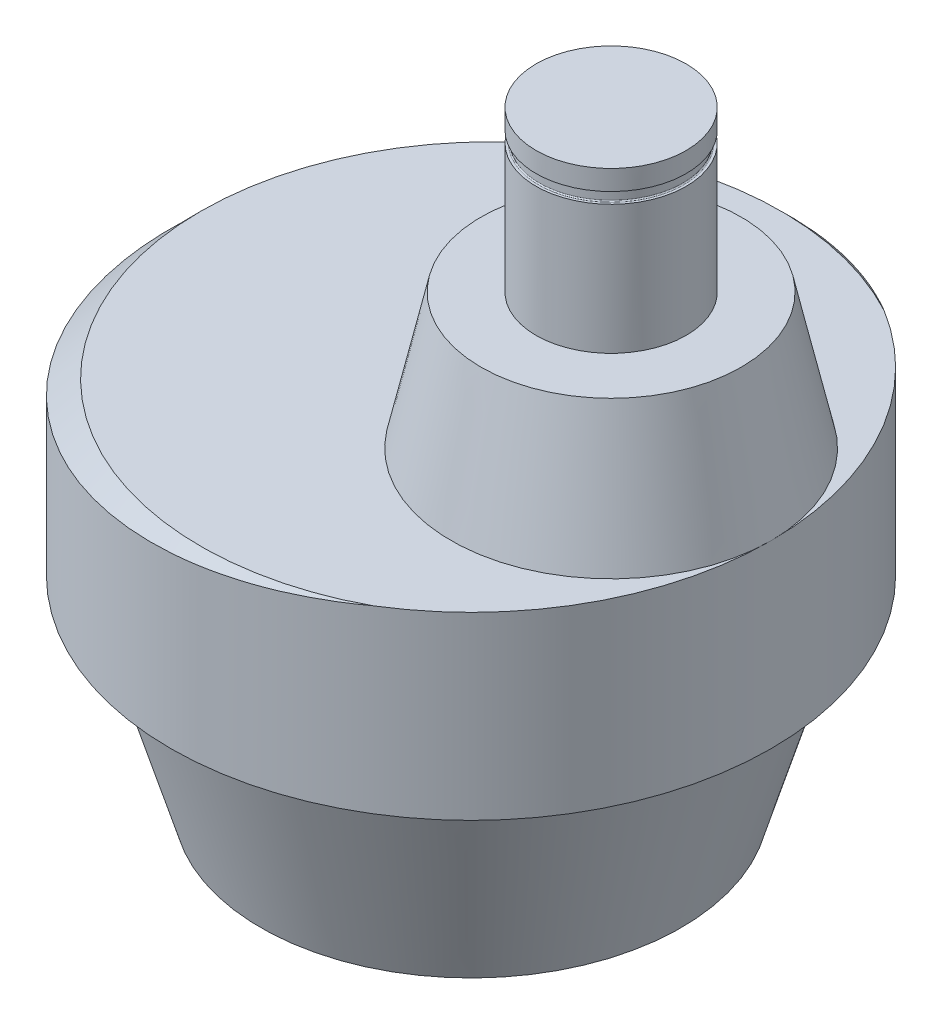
ISO-10303-21;
HEADER;
FILE_DESCRIPTION(('STEP AP214'),'2;1');
FILE_NAME('part.step','',(''),(''),'','','');
FILE_SCHEMA(('AUTOMOTIVE_DESIGN { 1 0 10303 214 1 1 1 1 }'));
ENDSEC;
DATA;
#1=APPLICATION_CONTEXT('core data for automotive mechanical design processes');
#2=APPLICATION_PROTOCOL_DEFINITION('international standard','automotive_design',2000,#1);
#3=PRODUCT_CONTEXT('',#1,'mechanical');
#4=PRODUCT('Part','Part','',(#3));
#5=PRODUCT_RELATED_PRODUCT_CATEGORY('part','',(#4));
#6=PRODUCT_DEFINITION_FORMATION('','',#4);
#7=PRODUCT_DEFINITION_CONTEXT('part definition',#1,'design');
#8=PRODUCT_DEFINITION('design','',#6,#7);
#9=PRODUCT_DEFINITION_SHAPE('','',#8);
#10=(LENGTH_UNIT() NAMED_UNIT(*) SI_UNIT(.MILLI.,.METRE.));
#11=(NAMED_UNIT(*) PLANE_ANGLE_UNIT() SI_UNIT($,.RADIAN.));
#12=(NAMED_UNIT(*) SI_UNIT($,.STERADIAN.) SOLID_ANGLE_UNIT());
#13=UNCERTAINTY_MEASURE_WITH_UNIT(LENGTH_MEASURE(1.E-05),#10,'distance_accuracy_value','');
#14=(GEOMETRIC_REPRESENTATION_CONTEXT(3) GLOBAL_UNCERTAINTY_ASSIGNED_CONTEXT((#13)) GLOBAL_UNIT_ASSIGNED_CONTEXT((#10,
#11,#12)) REPRESENTATION_CONTEXT('',''));
#15=CARTESIAN_POINT('',(0.,0.,0.));
#16=DIRECTION('',(0.,0.,1.));
#17=DIRECTION('',(1.,0.,0.));
#18=AXIS2_PLACEMENT_3D('',#15,#16,#17);
#19=CARTESIAN_POINT('',(14.,67.4999999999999,0.));
#20=DIRECTION('',(0.,-1.,0.));
#21=DIRECTION('',(0.,0.,-1.));
#22=AXIS2_PLACEMENT_3D('',#19,#20,#21);
#23=CYLINDRICAL_SURFACE('',#22,7.5);
#24=CARTESIAN_POINT('',(14.,51.4999999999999,0.));
#25=DIRECTION('',(0.,1.,0.));
#26=DIRECTION('',(0.,0.,1.));
#27=AXIS2_PLACEMENT_3D('',#24,#25,#26);
#28=CIRCLE('',#27,7.5);
#29=CARTESIAN_POINT('',(14.,51.4999999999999,7.5));
#30=VERTEX_POINT('',#29);
#31=EDGE_CURVE('E74',#30,#30,#28,.T.);
#32=ORIENTED_EDGE('',*,*,#31,.T.);
#33=EDGE_LOOP('',(#32));
#34=FACE_BOUND('',#33,.T.);
#35=CARTESIAN_POINT('',(14.,64.3999999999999,0.));
#36=DIRECTION('',(0.,-1.,0.));
#37=DIRECTION('',(0.,0.,-1.));
#38=AXIS2_PLACEMENT_3D('',#35,#36,#37);
#39=CIRCLE('',#38,7.50000000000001);
#40=CARTESIAN_POINT('',(14.,64.3999999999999,-7.50000000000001));
#41=VERTEX_POINT('',#40);
#42=EDGE_CURVE('E152',#41,#41,#39,.T.);
#43=ORIENTED_EDGE('',*,*,#42,.T.);
#44=EDGE_LOOP('',(#43));
#45=FACE_BOUND('',#44,.T.);
#46=ADVANCED_FACE('F34',(#34,#45),#23,.T.);
#47=CARTESIAN_POINT('',(14.,51.4999999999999,0.));
#48=DIRECTION('',(0.,1.,0.));
#49=DIRECTION('',(0.,0.,1.));
#50=AXIS2_PLACEMENT_3D('',#47,#48,#49);
#51=PLANE('',#50);
#52=CARTESIAN_POINT('',(14.,51.4999999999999,0.));
#53=DIRECTION('',(0.,1.,0.));
#54=DIRECTION('',(0.,0.,1.));
#55=AXIS2_PLACEMENT_3D('',#52,#53,#54);
#56=CIRCLE('',#55,13.);
#57=CARTESIAN_POINT('',(14.,51.4999999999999,13.));
#58=VERTEX_POINT('',#57);
#59=EDGE_CURVE('E91',#58,#58,#56,.T.);
#60=ORIENTED_EDGE('',*,*,#59,.T.);
#61=EDGE_LOOP('',(#60));
#62=FACE_BOUND('',#61,.T.);
#63=ORIENTED_EDGE('',*,*,#31,.F.);
#64=EDGE_LOOP('',(#63));
#65=FACE_BOUND('',#64,.T.);
#66=ADVANCED_FACE('F108',(#62,#65),#51,.T.);
#67=CARTESIAN_POINT('',(0.,37.9999999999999,0.));
#68=DIRECTION('',(0.,1.,0.));
#69=DIRECTION('',(0.,0.,1.));
#70=AXIS2_PLACEMENT_3D('',#67,#68,#69);
#71=PLANE('',#70);
#72=CARTESIAN_POINT('',(2.,37.9999999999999,0.));
#73=DIRECTION('',(0.,1.,0.));
#74=DIRECTION('',(0.,0.,1.));
#75=AXIS2_PLACEMENT_3D('',#72,#73,#74);
#76=CIRCLE('',#75,29.);
#77=CARTESIAN_POINT('',(15.75,37.9999999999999,-25.5330667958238));
#78=VERTEX_POINT('',#77);
#79=CARTESIAN_POINT('',(15.75,37.9999999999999,25.5330667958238));
#80=VERTEX_POINT('',#79);
#81=EDGE_CURVE('E70',#78,#80,#76,.T.);
#82=ORIENTED_EDGE('',*,*,#81,.T.);
#83=CARTESIAN_POINT('',(0.,37.9999999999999,0.));
#84=DIRECTION('',(0.,-1.,0.));
#85=DIRECTION('',(0.,0.,-1.));
#86=AXIS2_PLACEMENT_3D('',#83,#84,#85);
#87=CIRCLE('',#86,30.);
#88=CARTESIAN_POINT('',(29.9999999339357,37.9999999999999,0.00175288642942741));
#89=VERTEX_POINT('',#88);
#90=EDGE_CURVE('E217',#89,#80,#87,.T.);
#91=ORIENTED_EDGE('',*,*,#90,.F.);
#92=CARTESIAN_POINT('',(14.,37.9999999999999,0.));
#93=DIRECTION('',(0.,1.,0.));
#94=DIRECTION('',(0.,0.,1.));
#95=AXIS2_PLACEMENT_3D('',#92,#93,#94);
#96=CIRCLE('',#95,16.);
#97=EDGE_CURVE('E84',#89,#89,#96,.T.);
#98=ORIENTED_EDGE('',*,*,#97,.F.);
#99=EDGE_CURVE('E51',#78,#89,#87,.T.);
#100=ORIENTED_EDGE('',*,*,#99,.F.);
#101=EDGE_LOOP('',(#82,#91,#98,#100));
#102=FACE_BOUND('',#101,.T.);
#103=ADVANCED_FACE('F111',(#102),#71,.T.);
#104=CARTESIAN_POINT('',(21.,0.,0.));
#105=DIRECTION('',(0.,-1.,0.));
#106=DIRECTION('',(0.,0.,-1.));
#107=AXIS2_PLACEMENT_3D('',#104,#105,#106);
#108=PLANE('',#107);
#109=CARTESIAN_POINT('',(0.,0.,0.));
#110=DIRECTION('',(0.,-1.,0.));
#111=DIRECTION('',(0.,0.,-1.));
#112=AXIS2_PLACEMENT_3D('',#109,#110,#111);
#113=CIRCLE('',#112,13.);
#114=CARTESIAN_POINT('',(0.,0.,-13.));
#115=VERTEX_POINT('',#114);
#116=EDGE_CURVE('E71',#115,#115,#113,.T.);
#117=ORIENTED_EDGE('',*,*,#116,.F.);
#118=EDGE_LOOP('',(#117));
#119=FACE_BOUND('',#118,.T.);
#120=CARTESIAN_POINT('',(0.,0.,0.));
#121=DIRECTION('',(0.,-1.,0.));
#122=DIRECTION('',(0.,0.,-1.));
#123=AXIS2_PLACEMENT_3D('',#120,#121,#122);
#124=CIRCLE('',#123,21.);
#125=CARTESIAN_POINT('',(0.,0.,-21.));
#126=VERTEX_POINT('',#125);
#127=EDGE_CURVE('E43',#126,#126,#124,.T.);
#128=ORIENTED_EDGE('',*,*,#127,.T.);
#129=EDGE_LOOP('',(#128));
#130=FACE_BOUND('',#129,.T.);
#131=ADVANCED_FACE('F36',(#119,#130),#108,.T.);
#132=CARTESIAN_POINT('',(0.,0.,0.));
#133=DIRECTION('',(0.,1.,0.));
#134=DIRECTION('',(0.,0.,1.));
#135=AXIS2_PLACEMENT_3D('',#132,#133,#134);
#136=CONICAL_SURFACE('',#135,21.,0.291456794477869);
#137=CARTESIAN_POINT('',(0.,17.8620436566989,0.));
#138=DIRECTION('',(0.,-1.,0.));
#139=DIRECTION('',(0.,0.,-1.));
#140=AXIS2_PLACEMENT_3D('',#137,#138,#139);
#141=CIRCLE('',#140,26.3586130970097);
#142=CARTESIAN_POINT('',(0.,17.8620436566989,-26.3586130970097));
#143=VERTEX_POINT('',#142);
#144=EDGE_CURVE('E210',#143,#143,#141,.T.);
#145=ORIENTED_EDGE('',*,*,#144,.T.);
#146=EDGE_LOOP('',(#145));
#147=FACE_BOUND('',#146,.T.);
#148=ORIENTED_EDGE('',*,*,#127,.F.);
#149=EDGE_LOOP('',(#148));
#150=FACE_BOUND('',#149,.T.);
#151=ADVANCED_FACE('F206',(#147,#150),#136,.T.);
#152=CARTESIAN_POINT('',(0.,16.9999999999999,0.));
#153=DIRECTION('',(0.,-1.,0.));
#154=DIRECTION('',(0.,0.,-1.));
#155=AXIS2_PLACEMENT_3D('',#152,#153,#154);
#156=TOROIDAL_SURFACE('',#155,29.2320919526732,2.99999999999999);
#157=CARTESIAN_POINT('',(0.,19.9999999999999,0.));
#158=DIRECTION('',(0.,-1.,0.));
#159=DIRECTION('',(0.,0.,-1.));
#160=AXIS2_PLACEMENT_3D('',#157,#158,#159);
#161=CIRCLE('',#160,29.2320919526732);
#162=CARTESIAN_POINT('',(0.,19.9999999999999,-29.2320919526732));
#163=VERTEX_POINT('',#162);
#164=EDGE_CURVE('E213',#163,#163,#161,.T.);
#165=ORIENTED_EDGE('',*,*,#164,.T.);
#166=EDGE_LOOP('',(#165));
#167=FACE_BOUND('',#166,.T.);
#168=ORIENTED_EDGE('',*,*,#144,.F.);
#169=EDGE_LOOP('',(#168));
#170=FACE_BOUND('',#169,.T.);
#171=ADVANCED_FACE('F242',(#167,#170),#156,.F.);
#172=CARTESIAN_POINT('',(30.0000000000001,19.9999999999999,0.));
#173=DIRECTION('',(0.,-1.,0.));
#174=DIRECTION('',(0.,0.,-1.));
#175=AXIS2_PLACEMENT_3D('',#172,#173,#174);
#176=PLANE('',#175);
#177=CARTESIAN_POINT('',(0.,19.9999999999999,0.));
#178=DIRECTION('',(0.,-1.,0.));
#179=DIRECTION('',(0.,0.,-1.));
#180=AXIS2_PLACEMENT_3D('',#177,#178,#179);
#181=CIRCLE('',#180,30.);
#182=CARTESIAN_POINT('',(0.,19.9999999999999,-30.));
#183=VERTEX_POINT('',#182);
#184=EDGE_CURVE('E218',#183,#183,#181,.T.);
#185=ORIENTED_EDGE('',*,*,#184,.T.);
#186=EDGE_LOOP('',(#185));
#187=FACE_BOUND('',#186,.T.);
#188=ORIENTED_EDGE('',*,*,#164,.F.);
#189=EDGE_LOOP('',(#188));
#190=FACE_BOUND('',#189,.T.);
#191=ADVANCED_FACE('F118',(#187,#190),#176,.T.);
#192=CARTESIAN_POINT('',(0.,-11.5818835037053,0.));
#193=DIRECTION('',(0.,-1.,0.));
#194=DIRECTION('',(0.,0.,-1.));
#195=AXIS2_PLACEMENT_3D('',#192,#193,#194);
#196=CYLINDRICAL_SURFACE('',#195,30.);
#197=CARTESIAN_POINT('',(29.6948529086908,38.9782122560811,-4.26798673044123));
#198=CARTESIAN_POINT('',(29.5963193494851,38.9711796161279,-4.95353970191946));
#199=CARTESIAN_POINT('',(29.4740370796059,38.9624544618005,-5.635668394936));
#200=CARTESIAN_POINT('',(29.1825784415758,38.941671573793,-6.98976053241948));
#201=CARTESIAN_POINT('',(29.013403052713,38.9296139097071,-7.661724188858));
#202=CARTESIAN_POINT('',(28.6288764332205,38.9022299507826,-8.99263307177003));
#203=CARTESIAN_POINT('',(28.4135008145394,38.88690192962,-9.65157122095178));
#204=CARTESIAN_POINT('',(27.937682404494,38.8530719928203,-10.9528979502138));
#205=CARTESIAN_POINT('',(27.677237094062,38.8345698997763,-11.5952856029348));
#206=CARTESIAN_POINT('',(27.0520126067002,38.7902048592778,-12.9959967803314));
#207=CARTESIAN_POINT('',(26.6768346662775,38.7636141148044,-13.7496823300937));
#208=CARTESIAN_POINT('',(25.8645304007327,38.7061366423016,-15.2228038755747));
#209=CARTESIAN_POINT('',(25.427396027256,38.6752493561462,-15.9422354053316));
#210=CARTESIAN_POINT('',(24.4941371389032,38.609428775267,-17.3420030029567));
#211=CARTESIAN_POINT('',(23.9979886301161,38.5744938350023,-18.0223230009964));
#212=CARTESIAN_POINT('',(22.9504112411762,38.5008823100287,-19.3387228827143));
#213=CARTESIAN_POINT('',(22.3989840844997,38.4622058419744,-19.9748041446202));
#214=CARTESIAN_POINT('',(21.2438438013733,38.3813651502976,-21.199260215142));
#215=CARTESIAN_POINT('',(20.6400486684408,38.3391954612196,-21.7875573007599));
#216=CARTESIAN_POINT('',(19.3852314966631,38.2517655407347,-22.9111781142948));
#217=CARTESIAN_POINT('',(18.7342090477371,38.2065052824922,-23.4465013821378));
#218=CARTESIAN_POINT('',(17.3896331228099,38.1132618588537,-24.460366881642));
#219=CARTESIAN_POINT('',(16.6960834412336,38.0652789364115,-24.9389141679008));
#220=CARTESIAN_POINT('',(15.2713237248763,37.9669650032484,-25.8359307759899));
#221=CARTESIAN_POINT('',(14.5401137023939,37.9166339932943,-26.2544001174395));
#222=CARTESIAN_POINT('',(13.0434031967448,37.8138897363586,-27.0292709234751));
#223=CARTESIAN_POINT('',(12.2778241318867,37.7614717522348,-27.3855199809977));
#224=CARTESIAN_POINT('',(10.7194633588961,37.6550689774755,-28.032209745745));
#225=CARTESIAN_POINT('',(9.92668159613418,37.6010841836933,-28.3226503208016));
#226=CARTESIAN_POINT('',(8.31951972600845,37.4919519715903,-28.8356923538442));
#227=CARTESIAN_POINT('',(7.50513908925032,37.4368045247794,-29.0582921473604));
#228=CARTESIAN_POINT('',(5.8605686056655,37.3257551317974,-29.434082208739));
#229=CARTESIAN_POINT('',(5.03037874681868,37.2698531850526,-29.5872724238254));
#230=CARTESIAN_POINT('',(3.35862243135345,37.1576028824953,-29.8233719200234));
#231=CARTESIAN_POINT('',(2.51703878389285,37.1012539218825,-29.9061592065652));
#232=CARTESIAN_POINT('',(0.829882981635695,36.9886081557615,-30.0004190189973));
#233=CARTESIAN_POINT('',(-0.015689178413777,36.9323113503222,-30.0118914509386));
#234=CARTESIAN_POINT('',(-1.70481762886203,36.8201654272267,-29.963435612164));
#235=CARTESIAN_POINT('',(-2.54837391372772,36.7643163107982,-29.9035071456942));
#236=CARTESIAN_POINT('',(-4.22747359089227,36.6534521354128,-29.7126642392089));
#237=CARTESIAN_POINT('',(-5.06301698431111,36.5984370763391,-29.5817498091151));
#238=CARTESIAN_POINT('',(-6.72047114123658,36.4895944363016,-29.2497843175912));
#239=CARTESIAN_POINT('',(-7.54237648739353,36.4357673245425,-29.0487060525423));
#240=CARTESIAN_POINT('',(-9.16636639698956,36.3296840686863,-28.5778322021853));
#241=CARTESIAN_POINT('',(-9.96845095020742,36.2774279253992,-28.3080365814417));
#242=CARTESIAN_POINT('',(-11.5470747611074,36.1748328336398,-27.7016246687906));
#243=CARTESIAN_POINT('',(-12.3236140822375,36.1244938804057,-27.3650085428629));
#244=CARTESIAN_POINT('',(-13.8456004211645,36.026062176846,-26.6273262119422));
#245=CARTESIAN_POINT('',(-14.5910474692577,35.9779694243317,-26.2262600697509));
#246=CARTESIAN_POINT('',(-16.0447898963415,35.8843874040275,-25.3629390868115));
#247=CARTESIAN_POINT('',(-16.753121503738,35.8388955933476,-24.900745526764));
#248=CARTESIAN_POINT('',(-18.1283604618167,35.7507538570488,-23.9181259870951));
#249=CARTESIAN_POINT('',(-18.7952678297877,35.7081039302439,-23.3977000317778));
#250=CARTESIAN_POINT('',(-20.0828721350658,35.6259155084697,-22.3023025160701));
#251=CARTESIAN_POINT('',(-20.7035693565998,35.5863769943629,-21.7273312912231));
#252=CARTESIAN_POINT('',(-21.8942979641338,35.5106585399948,-20.5269193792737));
#253=CARTESIAN_POINT('',(-22.4643294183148,35.4744785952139,-19.9014787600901));
#254=CARTESIAN_POINT('',(-23.5486188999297,35.4057654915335,-18.6057749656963));
#255=CARTESIAN_POINT('',(-24.0629781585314,35.3732257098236,-17.9355968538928));
#256=CARTESIAN_POINT('',(-25.0334346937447,35.3119158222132,-16.5541443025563));
#257=CARTESIAN_POINT('',(-25.48953203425,35.2831457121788,-15.8428699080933));
#258=CARTESIAN_POINT('',(-26.3401784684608,35.2295509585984,-14.3842885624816));
#259=CARTESIAN_POINT('',(-26.7347280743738,35.2047262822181,-13.6369819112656));
#260=CARTESIAN_POINT('',(-27.4594390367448,35.1591728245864,-12.1116539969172));
#261=CARTESIAN_POINT('',(-27.7896004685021,35.1384440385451,-11.3336327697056));
#262=CARTESIAN_POINT('',(-28.3825829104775,35.101243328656,-9.75394217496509));
#263=CARTESIAN_POINT('',(-28.6455317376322,35.0847633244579,-8.95232097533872));
#264=CARTESIAN_POINT('',(-29.1030206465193,35.0561071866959,-7.32971506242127));
#265=CARTESIAN_POINT('',(-29.2975608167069,35.0439310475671,-6.5087303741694));
#266=CARTESIAN_POINT('',(-29.6168296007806,35.0239555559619,-4.85325016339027));
#267=CARTESIAN_POINT('',(-29.7415586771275,35.016156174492,-4.01875473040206));
#268=CARTESIAN_POINT('',(-29.9203077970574,35.0049806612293,-2.34219557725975));
#269=CARTESIAN_POINT('',(-29.9743278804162,35.0016045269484,-1.50013186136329));
#270=CARTESIAN_POINT('',(-30.0112465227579,34.9992970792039,0.184508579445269));
#271=CARTESIAN_POINT('',(-29.994233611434,35.0003602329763,1.0270833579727));
#272=CARTESIAN_POINT('',(-29.8894089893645,35.0069125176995,2.70779935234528));
#273=CARTESIAN_POINT('',(-29.8015973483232,35.0124016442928,3.54594057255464));
#274=CARTESIAN_POINT('',(-29.5558074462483,35.0277731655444,5.21182718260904));
#275=CARTESIAN_POINT('',(-29.3978293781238,35.0376555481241,6.03957260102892));
#276=CARTESIAN_POINT('',(-29.0128426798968,35.0617546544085,7.67878698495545));
#277=CARTESIAN_POINT('',(-28.785834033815,35.0759713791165,8.49025594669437));
#278=CARTESIAN_POINT('',(-28.2644501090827,35.1086521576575,10.091053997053));
#279=CARTESIAN_POINT('',(-27.9700832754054,35.1271156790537,10.880385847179));
#280=CARTESIAN_POINT('',(-27.3160797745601,35.1681803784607,12.4314174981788));
#281=CARTESIAN_POINT('',(-26.9564431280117,35.1907815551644,13.1931173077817));
#282=CARTESIAN_POINT('',(-26.174476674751,35.2399856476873,14.6834922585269));
#283=CARTESIAN_POINT('',(-25.7521467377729,35.2665885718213,15.4121673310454));
#284=CARTESIAN_POINT('',(-24.8478164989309,35.3236353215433,16.8313393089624));
#285=CARTESIAN_POINT('',(-24.365816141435,35.3540791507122,17.5218361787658));
#286=CARTESIAN_POINT('',(-23.3450590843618,35.4186561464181,18.8604725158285));
#287=CARTESIAN_POINT('',(-22.8062440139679,35.4527931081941,19.5085672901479));
#288=CARTESIAN_POINT('',(-21.6761212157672,35.5245211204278,20.7570406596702));
#289=CARTESIAN_POINT('',(-21.0848134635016,35.562112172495,21.3574192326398));
#290=CARTESIAN_POINT('',(-19.8539191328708,35.6405163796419,22.5062351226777));
#291=CARTESIAN_POINT('',(-19.2143322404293,35.6813295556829,23.0546721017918));
#292=CARTESIAN_POINT('',(-17.8914361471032,35.7659235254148,24.0957462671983));
#293=CARTESIAN_POINT('',(-17.2081268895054,35.809704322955,24.5883833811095));
#294=CARTESIAN_POINT('',(-15.8013559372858,35.9000407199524,25.5152496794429));
#295=CARTESIAN_POINT('',(-15.0778231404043,35.9466012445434,25.9493704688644));
#296=CARTESIAN_POINT('',(-13.5968981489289,36.0421274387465,26.7550919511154));
#297=CARTESIAN_POINT('',(-12.8395059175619,36.0910931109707,27.1266925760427));
#298=CARTESIAN_POINT('',(-11.2962374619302,36.1911140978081,27.804772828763));
#299=CARTESIAN_POINT('',(-10.5103610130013,36.2421694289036,28.1112519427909));
#300=CARTESIAN_POINT('',(-8.91570403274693,36.3460359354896,28.656943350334));
#301=CARTESIAN_POINT('',(-8.1069234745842,36.3988471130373,28.8961555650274));
#302=CARTESIAN_POINT('',(-6.47060788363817,36.5059791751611,29.3060401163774));
#303=CARTESIAN_POINT('',(-5.6430396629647,36.5603027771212,29.4765792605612));
#304=CARTESIAN_POINT('',(-3.9765381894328,36.6699957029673,29.7472649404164));
#305=CARTESIAN_POINT('',(-3.13760492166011,36.7253650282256,29.847411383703));
#306=CARTESIAN_POINT('',(-1.45431941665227,36.8367710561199,29.9766158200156));
#307=CARTESIAN_POINT('',(-0.609967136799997,36.8928077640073,30.0056732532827));
#308=CARTESIAN_POINT('',(1.07816267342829,37.0051586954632,29.9924999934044));
#309=CARTESIAN_POINT('',(1.92194020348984,37.0614729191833,29.9502692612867));
#310=CARTESIAN_POINT('',(3.60397939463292,37.1740506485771,29.7947239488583));
#311=CARTESIAN_POINT('',(4.4422329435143,37.2303140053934,29.6813215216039));
#312=CARTESIAN_POINT('',(6.10621021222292,37.3423147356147,29.3841535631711));
#313=CARTESIAN_POINT('',(6.93193391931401,37.3980521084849,29.2003879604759));
#314=CARTESIAN_POINT('',(8.56498242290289,37.5085923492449,28.7637870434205));
#315=CARTESIAN_POINT('',(9.37230715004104,37.5633952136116,28.5109514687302));
#316=CARTESIAN_POINT('',(10.9628080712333,37.6716570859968,27.9379908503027));
#317=CARTESIAN_POINT('',(11.7459842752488,37.7251160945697,27.6178658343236));
#318=CARTESIAN_POINT('',(13.282561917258,37.8302808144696,26.9126015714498));
#319=CARTESIAN_POINT('',(14.0359651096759,37.8819866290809,26.5274661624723));
#320=CARTESIAN_POINT('',(15.5076687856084,37.9832481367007,25.6948824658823));
#321=CARTESIAN_POINT('',(16.2259692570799,38.0328038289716,25.2474341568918));
#322=CARTESIAN_POINT('',(17.6223152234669,38.1293735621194,24.2933938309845));
#323=CARTESIAN_POINT('',(18.3003616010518,38.1763876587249,23.7868031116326));
#324=CARTESIAN_POINT('',(19.6113563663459,38.2674983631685,22.7180529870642));
#325=CARTESIAN_POINT('',(20.2443048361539,38.3115949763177,22.1558936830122));
#326=CARTESIAN_POINT('',(21.4596238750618,38.3964459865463,20.9808926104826));
#327=CARTESIAN_POINT('',(22.0420705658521,38.4372054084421,20.3681299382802));
#328=CARTESIAN_POINT('',(23.1532915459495,38.5151206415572,19.0955146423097));
#329=CARTESIAN_POINT('',(23.6820657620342,38.5522764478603,18.4356619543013));
#330=CARTESIAN_POINT('',(24.6821874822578,38.6226764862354,17.0734778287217));
#331=CARTESIAN_POINT('',(25.1535288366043,38.6559202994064,16.3711418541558));
#332=CARTESIAN_POINT('',(26.0353121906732,38.7182086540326,14.9290586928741));
#333=CARTESIAN_POINT('',(26.4457548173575,38.7472532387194,14.1893118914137));
#334=CARTESIAN_POINT('',(27.201967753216,38.8008360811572,12.6792918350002));
#335=CARTESIAN_POINT('',(27.5478741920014,38.8253838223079,11.9090870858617));
#336=CARTESIAN_POINT('',(28.173609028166,38.8698372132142,10.3421220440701));
#337=CARTESIAN_POINT('',(28.4534351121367,38.8897427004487,9.54536082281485));
#338=CARTESIAN_POINT('',(28.9448455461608,38.9247275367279,7.93140597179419));
#339=CARTESIAN_POINT('',(29.1564636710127,38.9398092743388,7.11422267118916));
#340=CARTESIAN_POINT('',(29.5100925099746,38.9650255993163,5.46493413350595));
#341=CARTESIAN_POINT('',(29.6521134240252,38.9751609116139,4.63283110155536));
#342=CARTESIAN_POINT('',(29.8441624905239,38.9888703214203,3.12742868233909));
#343=CARTESIAN_POINT('',(29.906923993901,38.9933523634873,2.45573033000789));
#344=CARTESIAN_POINT('',(29.9870507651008,38.9990749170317,1.10962906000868));
#345=CARTESIAN_POINT('',(30.0044187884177,39.0003156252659,0.435226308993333));
#346=CARTESIAN_POINT('',(29.9936798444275,38.9995485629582,-0.912887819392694));
#347=CARTESIAN_POINT('',(29.9655944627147,38.9975423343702,-1.58659937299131));
#348=CARTESIAN_POINT('',(29.8641201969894,38.9902957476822,-2.93061699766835));
#349=CARTESIAN_POINT('',(29.7907290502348,38.9850552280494,-3.60092289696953));
#350=CARTESIAN_POINT('',(29.6948529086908,38.9782122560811,-4.26798673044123));
#351=B_SPLINE_CURVE_WITH_KNOTS('',3,(#197,#198,#199,#200,#201,#202,#203,#204,#205,#206,#207,
#208,#209,#210,#211,#212,#213,#214,#215,#216,#217,#218,#219,#220,#221,#222,#223,#224,#225,#226,
#227,#228,#229,#230,#231,#232,#233,#234,#235,#236,#237,#238,#239,#240,#241,#242,#243,#244,#245,
#246,#247,#248,#249,#250,#251,#252,#253,#254,#255,#256,#257,#258,#259,#260,#261,#262,#263,#264,
#265,#266,#267,#268,#269,#270,#271,#272,#273,#274,#275,#276,#277,#278,#279,#280,#281,#282,#283,
#284,#285,#286,#287,#288,#289,#290,#291,#292,#293,#294,#295,#296,#297,#298,#299,#300,#301,#302,
#303,#304,#305,#306,#307,#308,#309,#310,#311,#312,#313,#314,#315,#316,#317,#318,#319,#320,#321,
#322,#323,#324,#325,#326,#327,#328,#329,#330,#331,#332,#333,#334,#335,#336,#337,#338,#339,#340,
#341,#342,#343,#344,#345,#346,#347,#348,#349,#350),.UNSPECIFIED.,.T.,.F.,(4,2,2,2,2,2,2,2,2,2,2,
2,2,2,2,2,2,2,2,2,2,2,2,2,2,2,2,2,2,2,2,2,2,2,2,2,2,2,2,2,2,2,2,2,2,2,2,2,2,2,2,2,2,2,2,2,2,2,2,
2,2,2,2,2,2,2,2,2,2,2,2,2,2,2,2,2,4),(0.,2.07749384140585,4.15494430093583,6.23349410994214,
8.31216013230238,10.8360456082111,13.3602592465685,15.8855027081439,18.4106674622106,
20.9398605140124,23.4690755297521,25.9980652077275,28.5270540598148,31.0621532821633,
33.5972575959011,36.1324241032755,38.6675925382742,41.2071450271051,43.7467008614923,
46.2862636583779,48.8258261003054,51.3663742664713,53.9069237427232,56.4474669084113,
58.9880075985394,61.5260204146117,64.0640321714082,66.6020283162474,69.1400210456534,
71.6733184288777,74.2066130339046,76.7398865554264,79.2731571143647,81.801573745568,
84.3299871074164,86.8583837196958,89.3867789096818,91.912023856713,94.4372663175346,
96.9625018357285,99.4877379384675,102.012657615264,104.537576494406,107.062500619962,
109.587427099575,112.114973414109,114.64252090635,117.170084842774,119.697652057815,
122.229838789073,124.762028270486,127.294237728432,129.826450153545,132.363550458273,
134.900654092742,137.437777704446,139.974902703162,142.515165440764,145.055430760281,
147.595705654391,150.135979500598,152.676103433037,155.216228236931,157.756297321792,
160.296361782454,162.832528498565,165.368698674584,167.90514018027,170.441555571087,
172.972558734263,175.503650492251,178.033486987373,180.562952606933,182.585399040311,
184.607722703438,186.629086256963,188.650550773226),.UNSPECIFIED.);
#352=EDGE_CURVE('E12',#78,#80,#351,.T.);
#353=ORIENTED_EDGE('',*,*,#352,.F.);
#354=ORIENTED_EDGE('',*,*,#99,.T.);
#355=ORIENTED_EDGE('',*,*,#90,.T.);
#356=EDGE_LOOP('',(#353,#354,#355));
#357=FACE_BOUND('',#356,.T.);
#358=ORIENTED_EDGE('',*,*,#184,.F.);
#359=EDGE_LOOP('',(#358));
#360=FACE_BOUND('',#359,.T.);
#361=ADVANCED_FACE('F107',(#357,#360),#196,.T.);
#362=CARTESIAN_POINT('',(14.,51.4999999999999,0.));
#363=DIRECTION('',(0.,-1.,0.));
#364=DIRECTION('',(0.,0.,-1.));
#365=AXIS2_PLACEMENT_3D('',#362,#363,#364);
#366=CONICAL_SURFACE('',#365,13.,0.218668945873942);
#367=ORIENTED_EDGE('',*,*,#59,.F.);
#368=EDGE_LOOP('',(#367));
#369=FACE_BOUND('',#368,.T.);
#370=ORIENTED_EDGE('',*,*,#97,.T.);
#371=EDGE_LOOP('',(#370));
#372=FACE_BOUND('',#371,.T.);
#373=ADVANCED_FACE('F97',(#369,#372),#366,.T.);
#374=CARTESIAN_POINT('',(2.,34.9999999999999,0.));
#375=DIRECTION('',(0.,-1.,0.));
#376=DIRECTION('',(0.,0.,-1.));
#377=AXIS2_PLACEMENT_3D('',#374,#375,#376);
#378=CONICAL_SURFACE('',#377,32.,0.78539816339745);
#379=ORIENTED_EDGE('',*,*,#81,.F.);
#380=ORIENTED_EDGE('',*,*,#352,.T.);
#381=EDGE_LOOP('',(#379,#380));
#382=FACE_BOUND('',#381,.T.);
#383=ADVANCED_FACE('F64',(#382),#378,.T.);
#384=CARTESIAN_POINT('',(0.,30.,0.));
#385=DIRECTION('',(0.,-1.,0.));
#386=DIRECTION('',(0.,0.,-1.));
#387=AXIS2_PLACEMENT_3D('',#384,#385,#386);
#388=CONICAL_SURFACE('',#387,13.,1.02974425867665);
#389=CARTESIAN_POINT('',(0.,37.8111880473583,0.));
#390=VERTEX_POINT('',#389);
#391=VERTEX_LOOP('',#390);
#392=FACE_BOUND('',#391,.T.);
#393=CARTESIAN_POINT('',(0.,30.,0.));
#394=DIRECTION('',(0.,-1.,0.));
#395=DIRECTION('',(0.,0.,-1.));
#396=AXIS2_PLACEMENT_3D('',#393,#394,#395);
#397=CIRCLE('',#396,13.);
#398=CARTESIAN_POINT('',(0.,30.,-13.));
#399=VERTEX_POINT('',#398);
#400=EDGE_CURVE('E68',#399,#399,#397,.T.);
#401=ORIENTED_EDGE('',*,*,#400,.T.);
#402=EDGE_LOOP('',(#401));
#403=FACE_BOUND('',#402,.T.);
#404=ADVANCED_FACE('F60',(#392,#403),#388,.F.);
#405=CARTESIAN_POINT('',(0.,0.,0.));
#406=DIRECTION('',(0.,-1.,0.));
#407=DIRECTION('',(0.,0.,-1.));
#408=AXIS2_PLACEMENT_3D('',#405,#406,#407);
#409=CYLINDRICAL_SURFACE('',#408,13.);
#410=ORIENTED_EDGE('',*,*,#400,.F.);
#411=EDGE_LOOP('',(#410));
#412=FACE_BOUND('',#411,.T.);
#413=ORIENTED_EDGE('',*,*,#116,.T.);
#414=EDGE_LOOP('',(#413));
#415=FACE_BOUND('',#414,.T.);
#416=ADVANCED_FACE('F63',(#412,#415),#409,.F.);
#417=CARTESIAN_POINT('',(14.,65.4999999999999,-7.25999999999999));
#418=DIRECTION('',(0.,-1.,0.));
#419=DIRECTION('',(0.,0.,-1.));
#420=AXIS2_PLACEMENT_3D('',#417,#418,#419);
#421=PLANE('',#420);
#422=CARTESIAN_POINT('',(14.,65.4999999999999,0.));
#423=DIRECTION('',(0.,-1.,0.));
#424=DIRECTION('',(0.,0.,-1.));
#425=AXIS2_PLACEMENT_3D('',#422,#423,#424);
#426=CIRCLE('',#425,7.50000000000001);
#427=CARTESIAN_POINT('',(14.,65.4999999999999,-7.50000000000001));
#428=VERTEX_POINT('',#427);
#429=EDGE_CURVE('E77',#428,#428,#426,.T.);
#430=ORIENTED_EDGE('',*,*,#429,.T.);
#431=EDGE_LOOP('',(#430));
#432=FACE_BOUND('',#431,.T.);
#433=CARTESIAN_POINT('',(14.,65.4999999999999,0.));
#434=DIRECTION('',(0.,-1.,0.));
#435=DIRECTION('',(0.,0.,-1.));
#436=AXIS2_PLACEMENT_3D('',#433,#434,#435);
#437=CIRCLE('',#436,7.26);
#438=CARTESIAN_POINT('',(14.,65.4999999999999,-7.25999999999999));
#439=VERTEX_POINT('',#438);
#440=EDGE_CURVE('E165',#439,#439,#437,.T.);
#441=ORIENTED_EDGE('',*,*,#440,.F.);
#442=EDGE_LOOP('',(#441));
#443=FACE_BOUND('',#442,.T.);
#444=ADVANCED_FACE('F170',(#432,#443),#421,.T.);
#445=CARTESIAN_POINT('',(14.,65.3899999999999,0.));
#446=DIRECTION('',(0.,-1.,0.));
#447=DIRECTION('',(0.,0.,-1.));
#448=AXIS2_PLACEMENT_3D('',#445,#446,#447);
#449=TOROIDAL_SURFACE('',#448,7.26,0.109999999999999);
#450=ORIENTED_EDGE('',*,*,#440,.T.);
#451=EDGE_LOOP('',(#450));
#452=FACE_BOUND('',#451,.T.);
#453=CARTESIAN_POINT('',(14.,65.3899999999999,0.));
#454=DIRECTION('',(0.,-1.,0.));
#455=DIRECTION('',(0.,0.,-1.));
#456=AXIS2_PLACEMENT_3D('',#453,#454,#455);
#457=CIRCLE('',#456,7.15);
#458=CARTESIAN_POINT('',(14.,65.3899999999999,-7.15));
#459=VERTEX_POINT('',#458);
#460=EDGE_CURVE('E162',#459,#459,#457,.T.);
#461=ORIENTED_EDGE('',*,*,#460,.F.);
#462=EDGE_LOOP('',(#461));
#463=FACE_BOUND('',#462,.T.);
#464=ADVANCED_FACE('F173',(#452,#463),#449,.F.);
#465=CARTESIAN_POINT('',(14.,117.558983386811,0.));
#466=DIRECTION('',(0.,-1.,0.));
#467=DIRECTION('',(0.,0.,-1.));
#468=AXIS2_PLACEMENT_3D('',#465,#466,#467);
#469=CYLINDRICAL_SURFACE('',#468,7.15);
#470=ORIENTED_EDGE('',*,*,#460,.T.);
#471=EDGE_LOOP('',(#470));
#472=FACE_BOUND('',#471,.T.);
#473=CARTESIAN_POINT('',(14.,64.5099999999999,0.));
#474=DIRECTION('',(0.,-1.,0.));
#475=DIRECTION('',(0.,0.,-1.));
#476=AXIS2_PLACEMENT_3D('',#473,#474,#475);
#477=CIRCLE('',#476,7.15);
#478=CARTESIAN_POINT('',(14.,64.5099999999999,-7.15));
#479=VERTEX_POINT('',#478);
#480=EDGE_CURVE('E157',#479,#479,#477,.T.);
#481=ORIENTED_EDGE('',*,*,#480,.F.);
#482=EDGE_LOOP('',(#481));
#483=FACE_BOUND('',#482,.T.);
#484=ADVANCED_FACE('F179',(#472,#483),#469,.T.);
#485=CARTESIAN_POINT('',(14.,64.5099999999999,0.));
#486=DIRECTION('',(0.,-1.,0.));
#487=DIRECTION('',(0.,0.,-1.));
#488=AXIS2_PLACEMENT_3D('',#485,#486,#487);
#489=TOROIDAL_SURFACE('',#488,7.26,0.109999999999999);
#490=ORIENTED_EDGE('',*,*,#480,.T.);
#491=EDGE_LOOP('',(#490));
#492=FACE_BOUND('',#491,.T.);
#493=CARTESIAN_POINT('',(14.,64.3999999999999,0.));
#494=DIRECTION('',(0.,-1.,0.));
#495=DIRECTION('',(0.,0.,-1.));
#496=AXIS2_PLACEMENT_3D('',#493,#494,#495);
#497=CIRCLE('',#496,7.26);
#498=CARTESIAN_POINT('',(14.,64.3999999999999,-7.26));
#499=VERTEX_POINT('',#498);
#500=EDGE_CURVE('E154',#499,#499,#497,.T.);
#501=ORIENTED_EDGE('',*,*,#500,.F.);
#502=EDGE_LOOP('',(#501));
#503=FACE_BOUND('',#502,.T.);
#504=ADVANCED_FACE('F185',(#492,#503),#489,.F.);
#505=CARTESIAN_POINT('',(14.,64.3999999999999,-7.50000000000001));
#506=DIRECTION('',(0.,1.,0.));
#507=DIRECTION('',(0.,0.,1.));
#508=AXIS2_PLACEMENT_3D('',#505,#506,#507);
#509=PLANE('',#508);
#510=ORIENTED_EDGE('',*,*,#500,.T.);
#511=EDGE_LOOP('',(#510));
#512=FACE_BOUND('',#511,.T.);
#513=ORIENTED_EDGE('',*,*,#42,.F.);
#514=EDGE_LOOP('',(#513));
#515=FACE_BOUND('',#514,.T.);
#516=ADVANCED_FACE('F134',(#512,#515),#509,.T.);
#517=CARTESIAN_POINT('',(14.,67.4999999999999,0.));
#518=DIRECTION('',(0.,1.,0.));
#519=DIRECTION('',(0.,0.,1.));
#520=AXIS2_PLACEMENT_3D('',#517,#518,#519);
#521=PLANE('',#520);
#522=CARTESIAN_POINT('',(14.,67.4999999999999,0.));
#523=DIRECTION('',(0.,1.,0.));
#524=DIRECTION('',(0.,0.,1.));
#525=AXIS2_PLACEMENT_3D('',#522,#523,#524);
#526=CIRCLE('',#525,7.5);
#527=CARTESIAN_POINT('',(14.,67.4999999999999,7.5));
#528=VERTEX_POINT('',#527);
#529=EDGE_CURVE('E81',#528,#528,#526,.T.);
#530=ORIENTED_EDGE('',*,*,#529,.T.);
#531=EDGE_LOOP('',(#530));
#532=FACE_BOUND('',#531,.T.);
#533=ADVANCED_FACE('F131',(#532),#521,.T.);
#534=ORIENTED_EDGE('',*,*,#529,.F.);
#535=EDGE_LOOP('',(#534));
#536=FACE_BOUND('',#535,.T.);
#537=ORIENTED_EDGE('',*,*,#429,.F.);
#538=EDGE_LOOP('',(#537));
#539=FACE_BOUND('',#538,.T.);
#540=ADVANCED_FACE('F133',(#536,#539),#23,.T.);
#541=CLOSED_SHELL('',(#46,#66,#103,#131,#151,#171,#191,#361,#373,#383,#404,#416,#444,#464,#484,
#504,#516,#533,#540));
#542=MANIFOLD_SOLID_BREP('B2',#541);
#543=ADVANCED_BREP_SHAPE_REPRESENTATION('',(#18,#542),#14);
#544=SHAPE_DEFINITION_REPRESENTATION(#9,#543);
ENDSEC;
END-ISO-10303-21;
